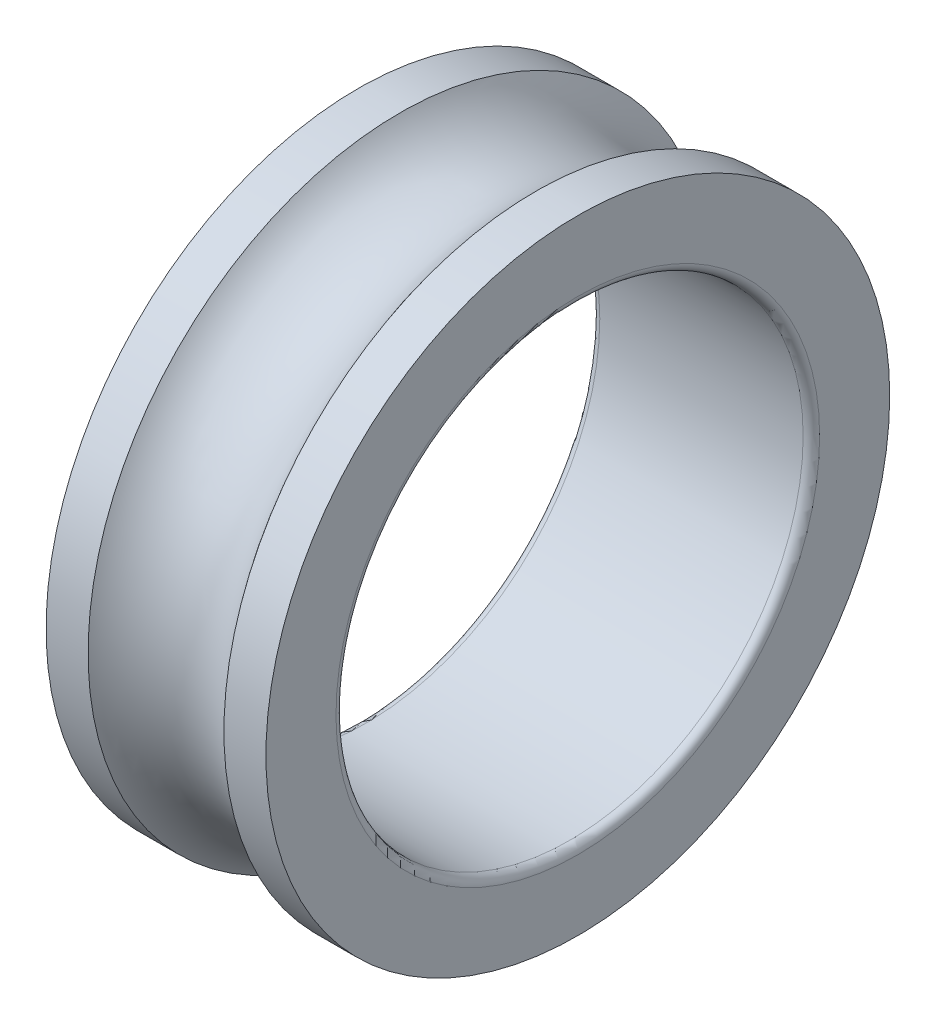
ISO-10303-21;
HEADER;
FILE_DESCRIPTION(('STEP AP214'),'2;1');
FILE_NAME('part.step','',(''),(''),'','','');
FILE_SCHEMA(('AUTOMOTIVE_DESIGN { 1 0 10303 214 1 1 1 1 }'));
ENDSEC;
DATA;
#1=APPLICATION_CONTEXT('core data for automotive mechanical design processes');
#2=APPLICATION_PROTOCOL_DEFINITION('international standard','automotive_design',2000,#1);
#3=PRODUCT_CONTEXT('',#1,'mechanical');
#4=PRODUCT('Part','Part','',(#3));
#5=PRODUCT_RELATED_PRODUCT_CATEGORY('part','',(#4));
#6=PRODUCT_DEFINITION_FORMATION('','',#4);
#7=PRODUCT_DEFINITION_CONTEXT('part definition',#1,'design');
#8=PRODUCT_DEFINITION('design','',#6,#7);
#9=PRODUCT_DEFINITION_SHAPE('','',#8);
#10=(LENGTH_UNIT() NAMED_UNIT(*) SI_UNIT(.MILLI.,.METRE.));
#11=(NAMED_UNIT(*) PLANE_ANGLE_UNIT() SI_UNIT($,.RADIAN.));
#12=(NAMED_UNIT(*) SI_UNIT($,.STERADIAN.) SOLID_ANGLE_UNIT());
#13=UNCERTAINTY_MEASURE_WITH_UNIT(LENGTH_MEASURE(1.E-05),#10,'distance_accuracy_value','');
#14=(GEOMETRIC_REPRESENTATION_CONTEXT(3) GLOBAL_UNCERTAINTY_ASSIGNED_CONTEXT((#13)) GLOBAL_UNIT_ASSIGNED_CONTEXT((#10,
#11,#12)) REPRESENTATION_CONTEXT('',''));
#15=CARTESIAN_POINT('',(0.,0.,0.));
#16=DIRECTION('',(0.,0.,1.));
#17=DIRECTION('',(1.,0.,0.));
#18=AXIS2_PLACEMENT_3D('',#15,#16,#17);
#19=CARTESIAN_POINT('',(4.,0.,0.));
#20=DIRECTION('',(1.,0.,0.));
#21=DIRECTION('',(0.,0.877582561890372,0.479425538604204));
#22=AXIS2_PLACEMENT_3D('',#19,#20,#21);
#23=TOROIDAL_SURFACE('',#22,13.05,3.);
#24=CARTESIAN_POINT('',(1.52815858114,0.,0.));
#25=DIRECTION('',(1.,0.,0.));
#26=DIRECTION('',(0.,0.,-1.));
#27=AXIS2_PLACEMENT_3D('',#24,#25,#26);
#28=CIRCLE('',#27,11.35);
#29=CARTESIAN_POINT('',(1.52815858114,0.,-11.35));
#30=VERTEX_POINT('',#29);
#31=EDGE_CURVE('E138',#30,#30,#28,.F.);
#32=ORIENTED_EDGE('',*,*,#31,.F.);
#33=EDGE_LOOP('',(#32));
#34=FACE_BOUND('',#33,.T.);
#35=CARTESIAN_POINT('',(6.47184141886,0.,0.));
#36=DIRECTION('',(1.,0.,0.));
#37=DIRECTION('',(0.,0.,-1.));
#38=AXIS2_PLACEMENT_3D('',#35,#36,#37);
#39=CIRCLE('',#38,11.35);
#40=CARTESIAN_POINT('',(6.47184141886,0.,-11.35));
#41=VERTEX_POINT('',#40);
#42=EDGE_CURVE('E141',#41,#41,#39,.T.);
#43=ORIENTED_EDGE('',*,*,#42,.F.);
#44=EDGE_LOOP('',(#43));
#45=FACE_BOUND('',#44,.T.);
#46=ADVANCED_FACE('F16',(#34,#45),#23,.F.);
#47=CARTESIAN_POINT('',(4.,0.,0.));
#48=DIRECTION('',(1.,0.,0.));
#49=DIRECTION('',(0.,0.,-1.));
#50=AXIS2_PLACEMENT_3D('',#47,#48,#49);
#51=CYLINDRICAL_SURFACE('',#50,11.35);
#52=ORIENTED_EDGE('',*,*,#42,.T.);
#53=EDGE_LOOP('',(#52));
#54=FACE_BOUND('',#53,.T.);
#55=CARTESIAN_POINT('',(8.,0.,0.));
#56=DIRECTION('',(1.,0.,0.));
#57=DIRECTION('',(0.,0.,-1.));
#58=AXIS2_PLACEMENT_3D('',#55,#56,#57);
#59=CIRCLE('',#58,11.35);
#60=CARTESIAN_POINT('',(8.,0.,-11.35));
#61=VERTEX_POINT('',#60);
#62=EDGE_CURVE('E60',#61,#61,#59,.T.);
#63=ORIENTED_EDGE('',*,*,#62,.F.);
#64=EDGE_LOOP('',(#63));
#65=FACE_BOUND('',#64,.T.);
#66=ADVANCED_FACE('F156',(#54,#65),#51,.T.);
#67=CARTESIAN_POINT('',(4.,0.,0.));
#68=DIRECTION('',(1.,0.,0.));
#69=DIRECTION('',(0.,0.,-1.));
#70=AXIS2_PLACEMENT_3D('',#67,#68,#69);
#71=CYLINDRICAL_SURFACE('',#70,11.35);
#72=CARTESIAN_POINT('',(0.,0.,0.));
#73=DIRECTION('',(1.,0.,0.));
#74=DIRECTION('',(0.,0.,-1.));
#75=AXIS2_PLACEMENT_3D('',#72,#73,#74);
#76=CIRCLE('',#75,11.35);
#77=CARTESIAN_POINT('',(0.,0.,-11.35));
#78=VERTEX_POINT('',#77);
#79=EDGE_CURVE('E59',#78,#78,#76,.T.);
#80=ORIENTED_EDGE('',*,*,#79,.T.);
#81=EDGE_LOOP('',(#80));
#82=FACE_BOUND('',#81,.T.);
#83=ORIENTED_EDGE('',*,*,#31,.T.);
#84=EDGE_LOOP('',(#83));
#85=FACE_BOUND('',#84,.T.);
#86=ADVANCED_FACE('F80',(#82,#85),#71,.T.);
#87=CARTESIAN_POINT('',(8.,8.8,0.));
#88=DIRECTION('',(1.,0.,0.));
#89=DIRECTION('',(0.,0.,-1.));
#90=AXIS2_PLACEMENT_3D('',#87,#88,#89);
#91=PLANE('',#90);
#92=CARTESIAN_POINT('',(8.,0.,0.));
#93=DIRECTION('',(1.,0.,0.));
#94=DIRECTION('',(0.,0.877582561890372,0.479425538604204));
#95=AXIS2_PLACEMENT_3D('',#92,#93,#94);
#96=CIRCLE('',#95,8.80000000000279);
#97=CARTESIAN_POINT('',(8.,7.72272654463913,4.21894473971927));
#98=VERTEX_POINT('',#97);
#99=CARTESIAN_POINT('',(8.,-7.72272654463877,-4.21894473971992));
#100=VERTEX_POINT('',#99);
#101=EDGE_CURVE('E47',#98,#100,#96,.T.);
#102=ORIENTED_EDGE('',*,*,#101,.F.);
#103=CARTESIAN_POINT('',(8.,0.,0.));
#104=DIRECTION('',(1.,0.,0.));
#105=DIRECTION('',(0.,-0.877582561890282,-0.47942553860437));
#106=AXIS2_PLACEMENT_3D('',#103,#104,#105);
#107=CIRCLE('',#106,8.80000000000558);
#108=EDGE_CURVE('E44',#100,#98,#107,.T.);
#109=ORIENTED_EDGE('',*,*,#108,.F.);
#110=EDGE_LOOP('',(#102,#109));
#111=FACE_BOUND('',#110,.T.);
#112=ORIENTED_EDGE('',*,*,#62,.T.);
#113=EDGE_LOOP('',(#112));
#114=FACE_BOUND('',#113,.T.);
#115=ADVANCED_FACE('F57',(#111,#114),#91,.T.);
#116=CARTESIAN_POINT('',(0.,11.35,0.));
#117=DIRECTION('',(1.,0.,0.));
#118=DIRECTION('',(0.,0.,-1.));
#119=AXIS2_PLACEMENT_3D('',#116,#117,#118);
#120=PLANE('',#119);
#121=CARTESIAN_POINT('',(0.,0.,0.));
#122=DIRECTION('',(-1.,0.,0.));
#123=DIRECTION('',(0.,-0.877582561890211,-0.479425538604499));
#124=AXIS2_PLACEMENT_3D('',#121,#122,#123);
#125=CIRCLE('',#124,8.80000000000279);
#126=CARTESIAN_POINT('',(0.,-7.72272654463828,-4.21894473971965));
#127=VERTEX_POINT('',#126);
#128=CARTESIAN_POINT('',(0.,7.72272654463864,4.218944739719));
#129=VERTEX_POINT('',#128);
#130=EDGE_CURVE('E53',#127,#129,#125,.T.);
#131=ORIENTED_EDGE('',*,*,#130,.F.);
#132=CARTESIAN_POINT('',(0.,0.,0.));
#133=DIRECTION('',(-1.,0.,0.));
#134=DIRECTION('',(0.,0.877582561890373,0.479425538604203));
#135=AXIS2_PLACEMENT_3D('',#132,#133,#134);
#136=CIRCLE('',#135,8.80000000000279);
#137=EDGE_CURVE('E35',#129,#127,#136,.T.);
#138=ORIENTED_EDGE('',*,*,#137,.F.);
#139=EDGE_LOOP('',(#131,#138));
#140=FACE_BOUND('',#139,.T.);
#141=ORIENTED_EDGE('',*,*,#79,.F.);
#142=EDGE_LOOP('',(#141));
#143=FACE_BOUND('',#142,.T.);
#144=ADVANCED_FACE('F79',(#140,#143),#120,.F.);
#145=CARTESIAN_POINT('',(7.7,0.,0.));
#146=DIRECTION('',(1.,0.,0.));
#147=DIRECTION('',(0.,0.877582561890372,0.479425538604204));
#148=AXIS2_PLACEMENT_3D('',#145,#146,#147);
#149=TOROIDAL_SURFACE('',#148,8.8,0.3);
#150=ORIENTED_EDGE('',*,*,#108,.T.);
#151=ORIENTED_EDGE('',*,*,#101,.T.);
#152=EDGE_LOOP('',(#150,#151));
#153=FACE_BOUND('',#152,.T.);
#154=CARTESIAN_POINT('',(7.7,0.,0.));
#155=DIRECTION('',(1.,0.,0.));
#156=DIRECTION('',(0.,0.,-1.));
#157=AXIS2_PLACEMENT_3D('',#154,#155,#156);
#158=CIRCLE('',#157,8.5);
#159=CARTESIAN_POINT('',(7.7,0.,-8.5));
#160=VERTEX_POINT('',#159);
#161=EDGE_CURVE('E27',#160,#160,#158,.F.);
#162=ORIENTED_EDGE('',*,*,#161,.T.);
#163=EDGE_LOOP('',(#162));
#164=FACE_BOUND('',#163,.T.);
#165=ADVANCED_FACE('F49',(#153,#164),#149,.T.);
#166=CARTESIAN_POINT('',(0.3,0.,0.));
#167=DIRECTION('',(1.,0.,0.));
#168=DIRECTION('',(0.,0.877582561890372,0.479425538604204));
#169=AXIS2_PLACEMENT_3D('',#166,#167,#168);
#170=TOROIDAL_SURFACE('',#169,8.8,0.3);
#171=CARTESIAN_POINT('',(0.3,0.,0.));
#172=DIRECTION('',(1.,0.,0.));
#173=DIRECTION('',(0.,0.,-1.));
#174=AXIS2_PLACEMENT_3D('',#171,#172,#173);
#175=CIRCLE('',#174,8.5);
#176=CARTESIAN_POINT('',(0.3,0.,-8.5));
#177=VERTEX_POINT('',#176);
#178=EDGE_CURVE('E11',#177,#177,#175,.T.);
#179=ORIENTED_EDGE('',*,*,#178,.T.);
#180=EDGE_LOOP('',(#179));
#181=FACE_BOUND('',#180,.T.);
#182=ORIENTED_EDGE('',*,*,#137,.T.);
#183=ORIENTED_EDGE('',*,*,#130,.T.);
#184=EDGE_LOOP('',(#182,#183));
#185=FACE_BOUND('',#184,.T.);
#186=ADVANCED_FACE('F108',(#181,#185),#170,.T.);
#187=CARTESIAN_POINT('',(4.,0.,0.));
#188=DIRECTION('',(1.,0.,0.));
#189=DIRECTION('',(0.,0.,-1.));
#190=AXIS2_PLACEMENT_3D('',#187,#188,#189);
#191=CYLINDRICAL_SURFACE('',#190,8.5);
#192=ORIENTED_EDGE('',*,*,#161,.F.);
#193=EDGE_LOOP('',(#192));
#194=FACE_BOUND('',#193,.T.);
#195=ORIENTED_EDGE('',*,*,#178,.F.);
#196=EDGE_LOOP('',(#195));
#197=FACE_BOUND('',#196,.T.);
#198=ADVANCED_FACE('F18',(#194,#197),#191,.F.);
#199=CLOSED_SHELL('',(#46,#66,#86,#115,#144,#165,#186,#198));
#200=MANIFOLD_SOLID_BREP('B1',#199);
#201=ADVANCED_BREP_SHAPE_REPRESENTATION('',(#18,#200),#14);
#202=SHAPE_DEFINITION_REPRESENTATION(#9,#201);
ENDSEC;
END-ISO-10303-21;
